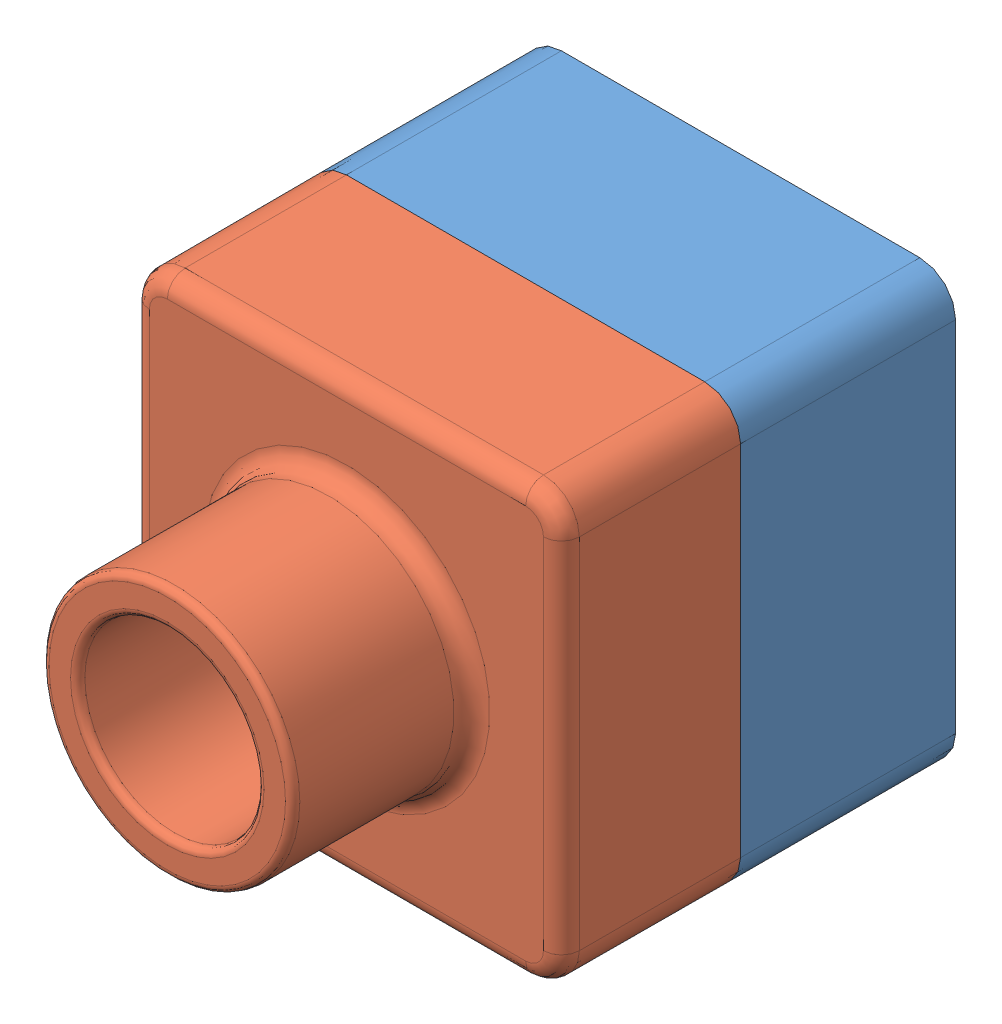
SolidWorks assembly Tutor Assembly.SLDASM, configuration Default (file format 8000). Lengths in mm.
Overall size (120 120 160).
2 component instances, 2 part files, 3 mates.
Components (placement in the parent):
- Tutor4-1: Tutor4.SLDPRT [Version 1] at origin size (120 120 90)
- Tutor3-1: Tutor3.SLDPRT [Default] at (0 0 110) size (120 120 100)
Mates (geometry in assembly coordinates):
- Coincident1: coincident aligned: plane of Tutor4-1 through (120 0 90) normal (1 0 0); plane of Tutor3-1 through (120 0 60) normal (1 0 0)
- Coincident2: coincident aligned: plane of Tutor4-1 through (0 120 90) normal (0 1 0); plane of Tutor3-1 through (0 120 60) normal (0 1 0)
- Coincident3: coincident aligned: line of Tutor4-1 through (110 120 60) axis (-1 0 0); line of Tutor3-1 through (110 120 60) axis (-1 0 0)
